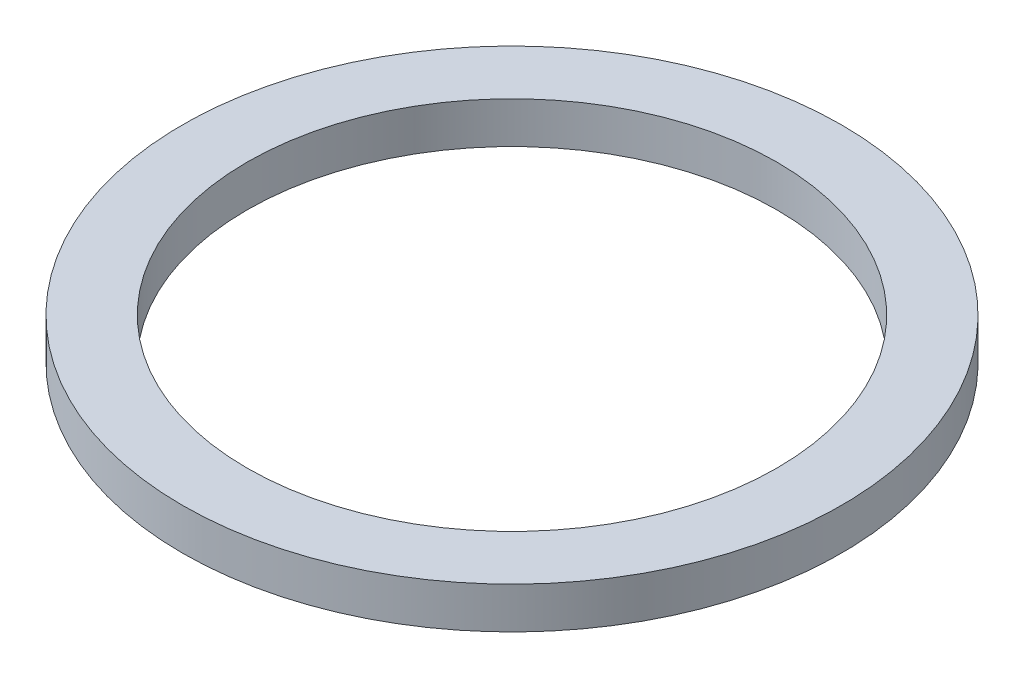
ISO-10303-21;
HEADER;
FILE_DESCRIPTION(('STEP AP214'),'2;1');
FILE_NAME('part.step','',(''),(''),'','','');
FILE_SCHEMA(('AUTOMOTIVE_DESIGN { 1 0 10303 214 1 1 1 1 }'));
ENDSEC;
DATA;
#1=APPLICATION_CONTEXT('core data for automotive mechanical design processes');
#2=APPLICATION_PROTOCOL_DEFINITION('international standard','automotive_design',2000,#1);
#3=PRODUCT_CONTEXT('',#1,'mechanical');
#4=PRODUCT('Part','Part','',(#3));
#5=PRODUCT_RELATED_PRODUCT_CATEGORY('part','',(#4));
#6=PRODUCT_DEFINITION_FORMATION('','',#4);
#7=PRODUCT_DEFINITION_CONTEXT('part definition',#1,'design');
#8=PRODUCT_DEFINITION('design','',#6,#7);
#9=PRODUCT_DEFINITION_SHAPE('','',#8);
#10=(LENGTH_UNIT() NAMED_UNIT(*) SI_UNIT(.MILLI.,.METRE.));
#11=(NAMED_UNIT(*) PLANE_ANGLE_UNIT() SI_UNIT($,.RADIAN.));
#12=(NAMED_UNIT(*) SI_UNIT($,.STERADIAN.) SOLID_ANGLE_UNIT());
#13=UNCERTAINTY_MEASURE_WITH_UNIT(LENGTH_MEASURE(1.E-05),#10,'distance_accuracy_value','');
#14=(GEOMETRIC_REPRESENTATION_CONTEXT(3) GLOBAL_UNCERTAINTY_ASSIGNED_CONTEXT((#13)) GLOBAL_UNIT_ASSIGNED_CONTEXT((#10,
#11,#12)) REPRESENTATION_CONTEXT('',''));
#15=CARTESIAN_POINT('',(0.,0.,0.));
#16=DIRECTION('',(0.,0.,1.));
#17=DIRECTION('',(1.,0.,0.));
#18=AXIS2_PLACEMENT_3D('',#15,#16,#17);
#19=CARTESIAN_POINT('',(0.,1.5875,0.));
#20=DIRECTION('',(0.,1.,0.));
#21=DIRECTION('',(0.,0.,1.));
#22=AXIS2_PLACEMENT_3D('',#19,#20,#21);
#23=PLANE('',#22);
#24=CARTESIAN_POINT('',(0.,1.5875,0.));
#25=DIRECTION('',(0.,1.,0.));
#26=DIRECTION('',(0.,0.,1.));
#27=AXIS2_PLACEMENT_3D('',#24,#25,#26);
#28=CIRCLE('',#27,12.6365);
#29=CARTESIAN_POINT('',(0.,1.5875,12.6365));
#30=VERTEX_POINT('',#29);
#31=EDGE_CURVE('E10',#30,#30,#28,.T.);
#32=ORIENTED_EDGE('',*,*,#31,.T.);
#33=EDGE_LOOP('',(#32));
#34=FACE_BOUND('',#33,.T.);
#35=CARTESIAN_POINT('',(0.,1.5875,0.));
#36=DIRECTION('',(0.,1.,0.));
#37=DIRECTION('',(0.,0.,1.));
#38=AXIS2_PLACEMENT_3D('',#35,#36,#37);
#39=CIRCLE('',#38,10.16);
#40=CARTESIAN_POINT('',(0.,1.5875,10.16));
#41=VERTEX_POINT('',#40);
#42=EDGE_CURVE('E42',#41,#41,#39,.T.);
#43=ORIENTED_EDGE('',*,*,#42,.F.);
#44=EDGE_LOOP('',(#43));
#45=FACE_BOUND('',#44,.T.);
#46=ADVANCED_FACE('F31',(#34,#45),#23,.T.);
#47=CARTESIAN_POINT('',(0.,0.,0.));
#48=DIRECTION('',(0.,1.,0.));
#49=DIRECTION('',(0.,0.,1.));
#50=AXIS2_PLACEMENT_3D('',#47,#48,#49);
#51=PLANE('',#50);
#52=CARTESIAN_POINT('',(0.,0.,0.));
#53=DIRECTION('',(0.,1.,0.));
#54=DIRECTION('',(0.,0.,1.));
#55=AXIS2_PLACEMENT_3D('',#52,#53,#54);
#56=CIRCLE('',#55,12.6365);
#57=CARTESIAN_POINT('',(0.,0.,12.6365));
#58=VERTEX_POINT('',#57);
#59=EDGE_CURVE('E35',#58,#58,#56,.T.);
#60=ORIENTED_EDGE('',*,*,#59,.F.);
#61=EDGE_LOOP('',(#60));
#62=FACE_BOUND('',#61,.T.);
#63=CARTESIAN_POINT('',(0.,0.,0.));
#64=DIRECTION('',(0.,1.,0.));
#65=DIRECTION('',(0.,0.,1.));
#66=AXIS2_PLACEMENT_3D('',#63,#64,#65);
#67=CIRCLE('',#66,10.16);
#68=CARTESIAN_POINT('',(0.,0.,10.16));
#69=VERTEX_POINT('',#68);
#70=EDGE_CURVE('E44',#69,#69,#67,.T.);
#71=ORIENTED_EDGE('',*,*,#70,.T.);
#72=EDGE_LOOP('',(#71));
#73=FACE_BOUND('',#72,.T.);
#74=ADVANCED_FACE('F54',(#62,#73),#51,.F.);
#75=CARTESIAN_POINT('',(0.,1.5875,0.));
#76=DIRECTION('',(0.,-1.,0.));
#77=DIRECTION('',(0.,0.,-1.));
#78=AXIS2_PLACEMENT_3D('',#75,#76,#77);
#79=CYLINDRICAL_SURFACE('',#78,12.6365);
#80=ORIENTED_EDGE('',*,*,#31,.F.);
#81=EDGE_LOOP('',(#80));
#82=FACE_BOUND('',#81,.T.);
#83=ORIENTED_EDGE('',*,*,#59,.T.);
#84=EDGE_LOOP('',(#83));
#85=FACE_BOUND('',#84,.T.);
#86=ADVANCED_FACE('F33',(#82,#85),#79,.T.);
#87=CARTESIAN_POINT('',(0.,1.5875,0.));
#88=DIRECTION('',(0.,-1.,0.));
#89=DIRECTION('',(0.,0.,-1.));
#90=AXIS2_PLACEMENT_3D('',#87,#88,#89);
#91=CYLINDRICAL_SURFACE('',#90,10.16);
#92=ORIENTED_EDGE('',*,*,#42,.T.);
#93=EDGE_LOOP('',(#92));
#94=FACE_BOUND('',#93,.T.);
#95=ORIENTED_EDGE('',*,*,#70,.F.);
#96=EDGE_LOOP('',(#95));
#97=FACE_BOUND('',#96,.T.);
#98=ADVANCED_FACE('F50',(#94,#97),#91,.F.);
#99=CLOSED_SHELL('',(#46,#74,#86,#98));
#100=MANIFOLD_SOLID_BREP('B2',#99);
#101=ADVANCED_BREP_SHAPE_REPRESENTATION('',(#18,#100),#14);
#102=SHAPE_DEFINITION_REPRESENTATION(#9,#101);
ENDSEC;
END-ISO-10303-21;
